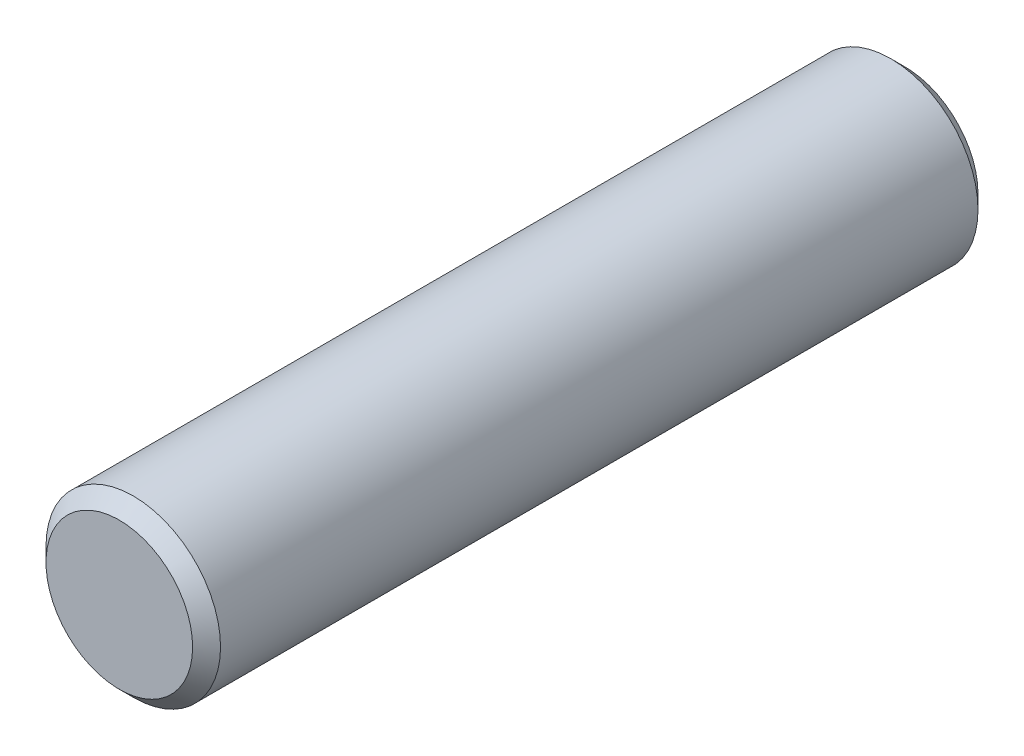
ISO-10303-21;
HEADER;
FILE_DESCRIPTION(('STEP AP214'),'2;1');
FILE_NAME('part.step','',(''),(''),'','','');
FILE_SCHEMA(('AUTOMOTIVE_DESIGN { 1 0 10303 214 1 1 1 1 }'));
ENDSEC;
DATA;
#1=APPLICATION_CONTEXT('core data for automotive mechanical design processes');
#2=APPLICATION_PROTOCOL_DEFINITION('international standard','automotive_design',2000,#1);
#3=PRODUCT_CONTEXT('',#1,'mechanical');
#4=PRODUCT('Part','Part','',(#3));
#5=PRODUCT_RELATED_PRODUCT_CATEGORY('part','',(#4));
#6=PRODUCT_DEFINITION_FORMATION('','',#4);
#7=PRODUCT_DEFINITION_CONTEXT('part definition',#1,'design');
#8=PRODUCT_DEFINITION('design','',#6,#7);
#9=PRODUCT_DEFINITION_SHAPE('','',#8);
#10=(LENGTH_UNIT() NAMED_UNIT(*) SI_UNIT(.MILLI.,.METRE.));
#11=(NAMED_UNIT(*) PLANE_ANGLE_UNIT() SI_UNIT($,.RADIAN.));
#12=(NAMED_UNIT(*) SI_UNIT($,.STERADIAN.) SOLID_ANGLE_UNIT());
#13=UNCERTAINTY_MEASURE_WITH_UNIT(LENGTH_MEASURE(1.E-05),#10,'distance_accuracy_value','');
#14=(GEOMETRIC_REPRESENTATION_CONTEXT(3) GLOBAL_UNCERTAINTY_ASSIGNED_CONTEXT((#13)) GLOBAL_UNIT_ASSIGNED_CONTEXT((#10,
#11,#12)) REPRESENTATION_CONTEXT('',''));
#15=CARTESIAN_POINT('',(0.,0.,0.));
#16=DIRECTION('',(0.,0.,1.));
#17=DIRECTION('',(1.,0.,0.));
#18=AXIS2_PLACEMENT_3D('',#15,#16,#17);
#19=CARTESIAN_POINT('',(0.,0.,-7.14375));
#20=DIRECTION('',(0.,0.,1.));
#21=DIRECTION('',(1.,0.,0.));
#22=AXIS2_PLACEMENT_3D('',#19,#20,#21);
#23=PLANE('',#22);
#24=CARTESIAN_POINT('',(0.,0.,-7.14375));
#25=DIRECTION('',(0.,0.,1.));
#26=DIRECTION('',(1.,0.,0.));
#27=AXIS2_PLACEMENT_3D('',#24,#25,#26);
#28=CIRCLE('',#27,1.3335);
#29=CARTESIAN_POINT('',(1.3335,0.,-7.14375));
#30=VERTEX_POINT('',#29);
#31=EDGE_CURVE('E10',#30,#30,#28,.T.);
#32=ORIENTED_EDGE('',*,*,#31,.F.);
#33=EDGE_LOOP('',(#32));
#34=FACE_BOUND('',#33,.T.);
#35=ADVANCED_FACE('F33',(#34),#23,.F.);
#36=CARTESIAN_POINT('',(0.,0.,-7.14375));
#37=DIRECTION('',(0.,0.,1.));
#38=DIRECTION('',(1.,0.,0.));
#39=AXIS2_PLACEMENT_3D('',#36,#37,#38);
#40=CONICAL_SURFACE('',#39,1.3335,0.78539816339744);
#41=CARTESIAN_POINT('',(0.,0.,-6.88975));
#42=DIRECTION('',(0.,0.,1.));
#43=DIRECTION('',(1.,0.,0.));
#44=AXIS2_PLACEMENT_3D('',#41,#42,#43);
#45=CIRCLE('',#44,1.5875);
#46=CARTESIAN_POINT('',(1.5875,0.,-6.88975));
#47=VERTEX_POINT('',#46);
#48=EDGE_CURVE('E39',#47,#47,#45,.T.);
#49=ORIENTED_EDGE('',*,*,#48,.F.);
#50=EDGE_LOOP('',(#49));
#51=FACE_BOUND('',#50,.T.);
#52=ORIENTED_EDGE('',*,*,#31,.T.);
#53=EDGE_LOOP('',(#52));
#54=FACE_BOUND('',#53,.T.);
#55=ADVANCED_FACE('F63',(#51,#54),#40,.T.);
#56=CARTESIAN_POINT('',(0.,0.,32.2742850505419));
#57=DIRECTION('',(0.,0.,1.));
#58=DIRECTION('',(1.,0.,0.));
#59=AXIS2_PLACEMENT_3D('',#56,#57,#58);
#60=CYLINDRICAL_SURFACE('',#59,1.5875);
#61=CARTESIAN_POINT('',(0.,0.,6.88975));
#62=DIRECTION('',(0.,0.,1.));
#63=DIRECTION('',(1.,0.,0.));
#64=AXIS2_PLACEMENT_3D('',#61,#62,#63);
#65=CIRCLE('',#64,1.5875);
#66=CARTESIAN_POINT('',(1.5875,0.,6.88975));
#67=VERTEX_POINT('',#66);
#68=EDGE_CURVE('E43',#67,#67,#65,.T.);
#69=ORIENTED_EDGE('',*,*,#68,.F.);
#70=EDGE_LOOP('',(#69));
#71=FACE_BOUND('',#70,.T.);
#72=ORIENTED_EDGE('',*,*,#48,.T.);
#73=EDGE_LOOP('',(#72));
#74=FACE_BOUND('',#73,.T.);
#75=ADVANCED_FACE('F58',(#71,#74),#60,.T.);
#76=CARTESIAN_POINT('',(0.,0.,6.88975));
#77=DIRECTION('',(0.,0.,-1.));
#78=DIRECTION('',(-1.,0.,0.));
#79=AXIS2_PLACEMENT_3D('',#76,#77,#78);
#80=CONICAL_SURFACE('',#79,1.5875,0.785398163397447);
#81=CARTESIAN_POINT('',(0.,0.,7.14375));
#82=DIRECTION('',(0.,0.,1.));
#83=DIRECTION('',(1.,0.,0.));
#84=AXIS2_PLACEMENT_3D('',#81,#82,#83);
#85=CIRCLE('',#84,1.3335);
#86=CARTESIAN_POINT('',(1.3335,0.,7.14375));
#87=VERTEX_POINT('',#86);
#88=EDGE_CURVE('E47',#87,#87,#85,.T.);
#89=ORIENTED_EDGE('',*,*,#88,.F.);
#90=EDGE_LOOP('',(#89));
#91=FACE_BOUND('',#90,.T.);
#92=ORIENTED_EDGE('',*,*,#68,.T.);
#93=EDGE_LOOP('',(#92));
#94=FACE_BOUND('',#93,.T.);
#95=ADVANCED_FACE('F55',(#91,#94),#80,.T.);
#96=CARTESIAN_POINT('',(0.,0.,7.14375));
#97=DIRECTION('',(0.,0.,-1.));
#98=DIRECTION('',(-1.,0.,0.));
#99=AXIS2_PLACEMENT_3D('',#96,#97,#98);
#100=PLANE('',#99);
#101=ORIENTED_EDGE('',*,*,#88,.T.);
#102=EDGE_LOOP('',(#101));
#103=FACE_BOUND('',#102,.T.);
#104=ADVANCED_FACE('F53',(#103),#100,.F.);
#105=CLOSED_SHELL('',(#35,#55,#75,#95,#104));
#106=MANIFOLD_SOLID_BREP('B2',#105);
#107=ADVANCED_BREP_SHAPE_REPRESENTATION('',(#18,#106),#14);
#108=SHAPE_DEFINITION_REPRESENTATION(#9,#107);
ENDSEC;
END-ISO-10303-21;
